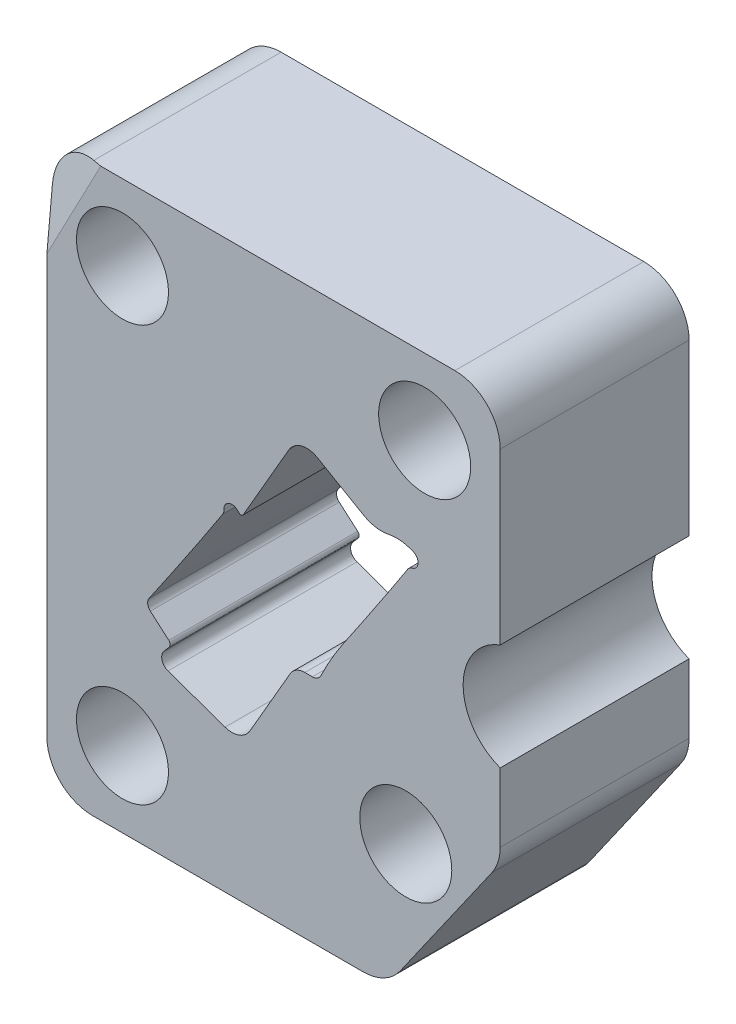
from build123d import *

# Parameters (mm, degrees)
BOSS_EXTRUDE1_DEPTH                                 = 31.75
SKETCH2_R                                           = 9.5377
CUT_EXTRUDE1_DEPTH                                  = 1126.948115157
HOLE1_D                                             = 10.3124
HOLE1_CBORE_D                                       = 15.4686
HOLE1_CBORE_DEPTH                                   = 17.526
CUT_EXTRUDE1_QU250515L_PUNCH5_MOUNTED_IN_DEPTH      = 1126.823885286
CUT_EXTRUDE1_QU250515L_PUNCH5_MOUNTED_IN_DEPTH_BACK = 1126.823885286


with BuildPart() as part:
    # Sketch1 → Boss-Extrude1 (new body)
    with BuildSketch(Plane.XY):
        with BuildLine():
            Line((-1116.33, 59.055), (-1055.37, 59.055))
            ThreePointArc((-1055.37, 59.055), (-1049.981846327, 56.823153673), (-1047.75, 51.435))
            Line((-1047.75, 51.435), (-1047.75, -6.533719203))
            ThreePointArc((-1047.75, -6.533719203), (-1048.102676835, -8.825097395), (-1049.128061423, -10.904371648))
            Line((-1049.128061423, -10.904371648), (-1064.561532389, -32.945652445))
            ThreePointArc((-1064.561532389, -32.945652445), (-1067.284946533, -35.334022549), (-1070.803470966, -36.195))
            Line((-1070.803470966, -36.195), (-1116.33, -36.195))
            ThreePointArc((-1116.33, -36.195), (-1121.718153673, -33.963153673), (-1123.95, -28.575))
            Line((-1123.95, -28.575), (-1123.95, 51.435))
            ThreePointArc((-1123.95, 51.435), (-1121.718153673, 56.823153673), (-1116.33, 59.055))
        make_face()
    extrude(amount=-BOSS_EXTRUDE1_DEPTH)

    # Sketch2 → Cut-Extrude1 (cut, through all)
    with BuildSketch(Plane.XY):
        with Locations((-1044.448, 13.97)):
            Circle(SKETCH2_R)
    extrude(amount=-CUT_EXTRUDE1_DEPTH, mode=Mode.SUBTRACT)

    # SurfaceCut1
    split(bisect_by=Plane(origin=(-36.34804059, 19.06055787, 199.914223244), x_dir=(-0.9840117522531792, -0.016904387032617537, -0.17729950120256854), z_dir=(0.17810354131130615, -0.09339575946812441, -0.9795694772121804)), keep=Keep.TOP)

    # Hole1 (through all)
    with Locations(Plane(origin=(-1124.119107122, -22.560000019, 0), x_dir=(1, 0, 0), z_dir=(0, 0, 1))):
        with Locations((12.869107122, -0.934999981), (60.494107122, 8.590000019), (63.669107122, 68.915000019), (12.869107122, 68.915000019)):
            CounterBoreHole(HOLE1_D / 2, HOLE1_CBORE_D / 2, HOLE1_CBORE_DEPTH)

    # Sketch1 QU250515L_Punch5_Mounted in the → Cut-Extrude1 QU250515L_Punch5_Mounted in (cut, two sides: drawn at the far end of the back side and taken through both)
    with BuildSketch(Plane.XY.offset(-4.7625).offset(-CUT_EXTRUDE1_QU250515L_PUNCH5_MOUNTED_IN_DEPTH_BACK)):
        with BuildLine():
            Line((-1080.596105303, 2.491012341), (-1079.326105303, 2.491012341))
            ThreePointArc((-1079.326105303, 2.491012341), (-1078.482514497, 2.733246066), (-1077.895956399, 3.386141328))
            ThreePointArc((-1077.895956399, 3.386141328), (-1076.15381746, 6.673566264), (-1074.185969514, 9.831062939))
            ThreePointArc((-1074.185969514, 9.831062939), (-1068.685184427, 17.980028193), (-1063.27939783, 26.192320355))
            ThreePointArc((-1063.27939783, 26.192320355), (-1062.967979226, 26.517142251), (-1062.559046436, 26.704931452))
            ThreePointArc((-1062.559046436, 26.704931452), (-1061.55753091, 27.922769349), (-1062.437229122, 29.231315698))
            Line((-1062.437229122, 29.231315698), (-1062.916339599, 29.400185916))
            ThreePointArc((-1062.916339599, 29.400185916), (-1064.679779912, 29.764048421), (-1066.47629226, 29.642965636))
            ThreePointArc((-1066.47629226, 29.642965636), (-1068.653529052, 29.596986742), (-1070.705110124, 30.327390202))
            Line((-1070.705110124, 30.327390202), (-1078.509234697, 34.833103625))
            ThreePointArc((-1078.509234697, 34.833103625), (-1081.161337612, 35.182259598), (-1083.283548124, 33.553830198))
            Line((-1083.283548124, 33.553830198), (-1090.944667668, 20.284381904))
            ThreePointArc((-1090.944667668, 20.284381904), (-1091.254927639, 20.069387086), (-1091.618065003, 20.172417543))
            Line((-1091.618065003, 20.172417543), (-1092.000759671, 20.506496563))
            ThreePointArc((-1092.000759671, 20.506496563), (-1093.460151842, 20.692268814), (-1094.185116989, 19.412127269))
            ThreePointArc((-1094.185116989, 19.412127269), (-1094.219453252, 19.021696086), (-1094.377376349, 18.662982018))
            ThreePointArc((-1094.377376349, 18.662982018), (-1100.521032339, 9.381201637), (-1106.784578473, 0.179900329))
            ThreePointArc((-1106.784578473, 0.179900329), (-1107.007824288, -0.735559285), (-1106.563748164, -1.566643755))
            Line((-1106.563748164, -1.566643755), (-1103.463467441, -4.259017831))
            ThreePointArc((-1103.463467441, -4.259017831), (-1103.225560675, -4.735601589), (-1103.394330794, -5.240822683))
            Line((-1103.394330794, -5.240822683), (-1104.264277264, -6.242569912))
            ThreePointArc((-1104.264277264, -6.242569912), (-1104.600993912, -7.691475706), (-1103.592312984, -8.784759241))
            Line((-1103.592312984, -8.784759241), (-1094.000774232, -12.165451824))
            ThreePointArc((-1094.000774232, -12.165451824), (-1091.626845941, -12.147298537), (-1089.812153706, -10.616691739))
            Line((-1089.812153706, -10.616691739), (-1083.06857319, 1.063532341))
            ThreePointArc((-1083.06857319, 1.063532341), (-1082.023585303, 2.108520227), (-1080.596105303, 2.491012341))
        make_face()
    extrude(amount=CUT_EXTRUDE1_QU250515L_PUNCH5_MOUNTED_IN_DEPTH + CUT_EXTRUDE1_QU250515L_PUNCH5_MOUNTED_IN_DEPTH_BACK, mode=Mode.SUBTRACT)


solid = part.part
